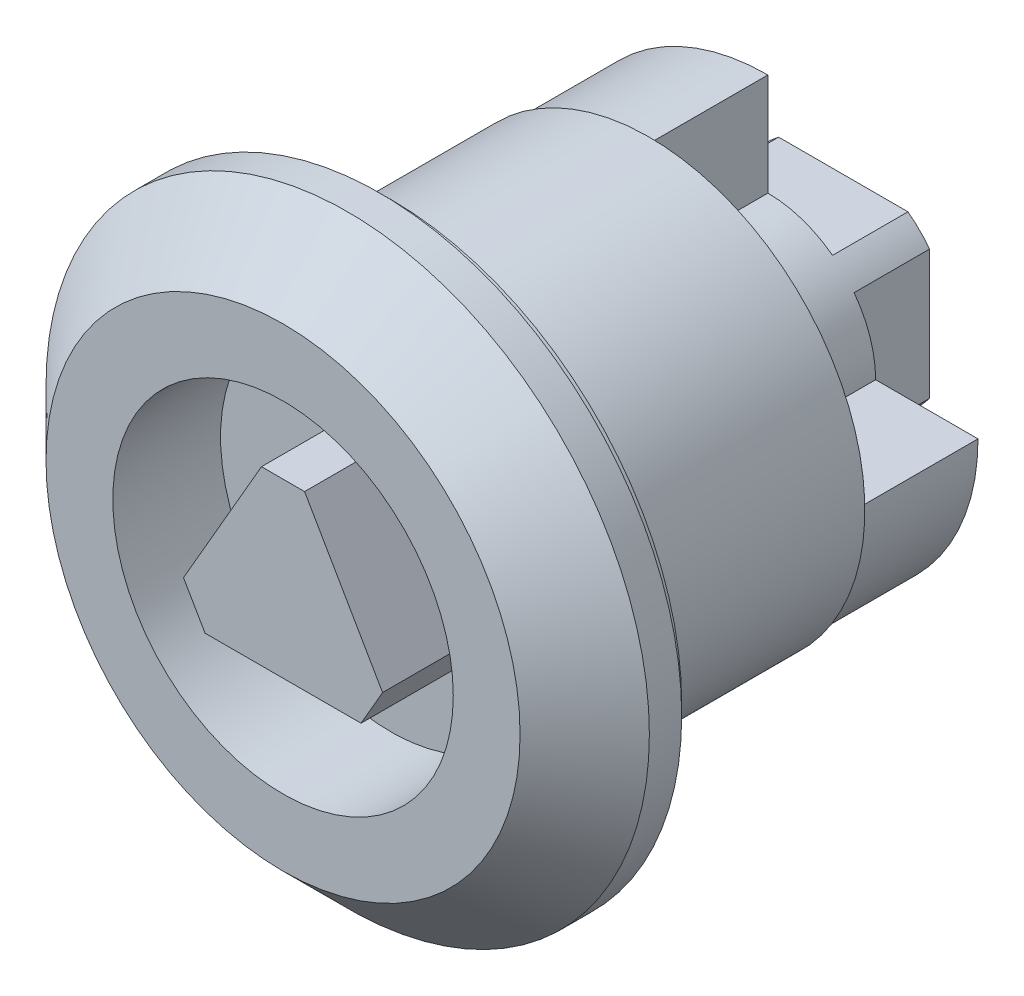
ISO-10303-21;
HEADER;
FILE_DESCRIPTION(('STEP AP214'),'2;1');
FILE_NAME('part.step','',(''),(''),'','','');
FILE_SCHEMA(('AUTOMOTIVE_DESIGN { 1 0 10303 214 1 1 1 1 }'));
ENDSEC;
DATA;
#1=APPLICATION_CONTEXT('core data for automotive mechanical design processes');
#2=APPLICATION_PROTOCOL_DEFINITION('international standard','automotive_design',2000,#1);
#3=PRODUCT_CONTEXT('',#1,'mechanical');
#4=PRODUCT('Part','Part','',(#3));
#5=PRODUCT_RELATED_PRODUCT_CATEGORY('part','',(#4));
#6=PRODUCT_DEFINITION_FORMATION('','',#4);
#7=PRODUCT_DEFINITION_CONTEXT('part definition',#1,'design');
#8=PRODUCT_DEFINITION('design','',#6,#7);
#9=PRODUCT_DEFINITION_SHAPE('','',#8);
#10=(LENGTH_UNIT() NAMED_UNIT(*) SI_UNIT(.MILLI.,.METRE.));
#11=(NAMED_UNIT(*) PLANE_ANGLE_UNIT() SI_UNIT($,.RADIAN.));
#12=(NAMED_UNIT(*) SI_UNIT($,.STERADIAN.) SOLID_ANGLE_UNIT());
#13=UNCERTAINTY_MEASURE_WITH_UNIT(LENGTH_MEASURE(1.E-05),#10,'distance_accuracy_value','');
#14=(GEOMETRIC_REPRESENTATION_CONTEXT(3) GLOBAL_UNCERTAINTY_ASSIGNED_CONTEXT((#13)) GLOBAL_UNIT_ASSIGNED_CONTEXT((#10,
#11,#12)) REPRESENTATION_CONTEXT('',''));
#15=CARTESIAN_POINT('',(0.,0.,0.));
#16=DIRECTION('',(0.,0.,1.));
#17=DIRECTION('',(1.,0.,0.));
#18=AXIS2_PLACEMENT_3D('',#15,#16,#17);
#19=CARTESIAN_POINT('',(0.,11.,5.));
#20=DIRECTION('',(0.,0.,1.));
#21=DIRECTION('',(1.,0.,0.));
#22=AXIS2_PLACEMENT_3D('',#19,#20,#21);
#23=PLANE('',#22);
#24=CARTESIAN_POINT('',(0.,0.,5.));
#25=DIRECTION('',(0.,0.,1.));
#26=DIRECTION('',(1.,0.,0.));
#27=AXIS2_PLACEMENT_3D('',#24,#25,#26);
#28=CIRCLE('',#27,7.9);
#29=CARTESIAN_POINT('',(7.9,0.,5.));
#30=VERTEX_POINT('',#29);
#31=EDGE_CURVE('E152',#30,#30,#28,.T.);
#32=ORIENTED_EDGE('',*,*,#31,.F.);
#33=EDGE_LOOP('',(#32));
#34=FACE_BOUND('',#33,.T.);
#35=CARTESIAN_POINT('',(0.,0.,5.));
#36=DIRECTION('',(0.,0.,-1.));
#37=DIRECTION('',(-1.,0.,0.));
#38=AXIS2_PLACEMENT_3D('',#35,#36,#37);
#39=CIRCLE('',#38,11.);
#40=CARTESIAN_POINT('',(-11.,0.,5.));
#41=VERTEX_POINT('',#40);
#42=EDGE_CURVE('E285',#41,#41,#39,.T.);
#43=ORIENTED_EDGE('',*,*,#42,.F.);
#44=EDGE_LOOP('',(#43));
#45=FACE_BOUND('',#44,.T.);
#46=ADVANCED_FACE('F14',(#34,#45),#23,.T.);
#47=CARTESIAN_POINT('',(0.,0.,-50.));
#48=DIRECTION('',(0.,0.,-1.));
#49=DIRECTION('',(-1.,0.,0.));
#50=AXIS2_PLACEMENT_3D('',#47,#48,#49);
#51=CYLINDRICAL_SURFACE('',#50,5.);
#52=CARTESIAN_POINT('',(0.,0.,-17.5));
#53=DIRECTION('',(0.,0.,-1.));
#54=DIRECTION('',(-1.,0.,0.));
#55=AXIS2_PLACEMENT_3D('',#52,#53,#54);
#56=CIRCLE('',#55,5.);
#57=CARTESIAN_POINT('',(-4.,3.,-17.5));
#58=VERTEX_POINT('',#57);
#59=CARTESIAN_POINT('',(-3.,4.,-17.5));
#60=VERTEX_POINT('',#59);
#61=EDGE_CURVE('E292',#58,#60,#56,.T.);
#62=ORIENTED_EDGE('',*,*,#61,.T.);
#63=DIRECTION('',(0.,0.,-1.));
#64=VECTOR('',#63,1.);
#65=CARTESIAN_POINT('',(-3.,4.,-11.4172374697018));
#66=LINE('',#65,#64);
#67=CARTESIAN_POINT('',(-3.,4.,-21.));
#68=VERTEX_POINT('',#67);
#69=EDGE_CURVE('E234',#60,#68,#66,.T.);
#70=ORIENTED_EDGE('',*,*,#69,.T.);
#71=CARTESIAN_POINT('',(0.,0.,-21.));
#72=DIRECTION('',(0.,0.,-1.));
#73=DIRECTION('',(-1.,0.,0.));
#74=AXIS2_PLACEMENT_3D('',#71,#72,#73);
#75=CIRCLE('',#74,5.);
#76=CARTESIAN_POINT('',(-4.,3.,-21.));
#77=VERTEX_POINT('',#76);
#78=EDGE_CURVE('E294',#77,#68,#75,.T.);
#79=ORIENTED_EDGE('',*,*,#78,.F.);
#80=DIRECTION('',(0.,0.,-1.));
#81=VECTOR('',#80,1.);
#82=CARTESIAN_POINT('',(-4.,3.,-11.4172374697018));
#83=LINE('',#82,#81);
#84=EDGE_CURVE('E258',#58,#77,#83,.T.);
#85=ORIENTED_EDGE('',*,*,#84,.F.);
#86=EDGE_LOOP('',(#62,#70,#79,#85));
#87=FACE_BOUND('',#86,.T.);
#88=ADVANCED_FACE('F350',(#87),#51,.T.);
#89=DIRECTION('',(0.,0.,-1.));
#90=VECTOR('',#89,1.);
#91=CARTESIAN_POINT('',(-3.,-4.,-11.4172374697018));
#92=LINE('',#91,#90);
#93=CARTESIAN_POINT('',(-3.,-4.,-17.5));
#94=VERTEX_POINT('',#93);
#95=CARTESIAN_POINT('',(-3.,-4.,-21.));
#96=VERTEX_POINT('',#95);
#97=EDGE_CURVE('E239',#94,#96,#92,.T.);
#98=ORIENTED_EDGE('',*,*,#97,.F.);
#99=CARTESIAN_POINT('',(-4.,-3.,-17.5));
#100=VERTEX_POINT('',#99);
#101=EDGE_CURVE('E299',#94,#100,#56,.T.);
#102=ORIENTED_EDGE('',*,*,#101,.T.);
#103=DIRECTION('',(0.,0.,-1.));
#104=VECTOR('',#103,1.);
#105=CARTESIAN_POINT('',(-4.,-3.,-11.4172374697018));
#106=LINE('',#105,#104);
#107=CARTESIAN_POINT('',(-4.,-3.,-21.));
#108=VERTEX_POINT('',#107);
#109=EDGE_CURVE('E255',#100,#108,#106,.T.);
#110=ORIENTED_EDGE('',*,*,#109,.T.);
#111=EDGE_CURVE('E293',#96,#108,#75,.T.);
#112=ORIENTED_EDGE('',*,*,#111,.F.);
#113=EDGE_LOOP('',(#98,#102,#110,#112));
#114=FACE_BOUND('',#113,.T.);
#115=ADVANCED_FACE('F346',(#114),#51,.T.);
#116=DIRECTION('',(0.,0.,-1.));
#117=VECTOR('',#116,1.);
#118=CARTESIAN_POINT('',(3.,-4.,-11.4172374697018));
#119=LINE('',#118,#117);
#120=CARTESIAN_POINT('',(3.,-4.,-17.5));
#121=VERTEX_POINT('',#120);
#122=CARTESIAN_POINT('',(3.,-4.,-21.));
#123=VERTEX_POINT('',#122);
#124=EDGE_CURVE('E244',#121,#123,#119,.T.);
#125=ORIENTED_EDGE('',*,*,#124,.T.);
#126=CARTESIAN_POINT('',(4.,-3.,-21.));
#127=VERTEX_POINT('',#126);
#128=EDGE_CURVE('E289',#127,#123,#75,.T.);
#129=ORIENTED_EDGE('',*,*,#128,.F.);
#130=DIRECTION('',(0.,0.,-1.));
#131=VECTOR('',#130,1.);
#132=CARTESIAN_POINT('',(4.,-3.,-11.4172374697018));
#133=LINE('',#132,#131);
#134=CARTESIAN_POINT('',(4.,-3.,-17.5));
#135=VERTEX_POINT('',#134);
#136=EDGE_CURVE('E260',#135,#127,#133,.T.);
#137=ORIENTED_EDGE('',*,*,#136,.F.);
#138=EDGE_CURVE('E295',#135,#121,#56,.T.);
#139=ORIENTED_EDGE('',*,*,#138,.T.);
#140=EDGE_LOOP('',(#125,#129,#137,#139));
#141=FACE_BOUND('',#140,.T.);
#142=ADVANCED_FACE('F359',(#141),#51,.T.);
#143=CARTESIAN_POINT('',(0.,5.,-21.));
#144=DIRECTION('',(0.,0.,1.));
#145=DIRECTION('',(1.,0.,0.));
#146=AXIS2_PLACEMENT_3D('',#143,#144,#145);
#147=PLANE('',#146);
#148=CARTESIAN_POINT('',(0.,0.,-21.));
#149=DIRECTION('',(0.,0.,-1.));
#150=DIRECTION('',(-1.,0.,0.));
#151=AXIS2_PLACEMENT_3D('',#148,#149,#150);
#152=CIRCLE('',#151,3.);
#153=CARTESIAN_POINT('',(-3.,0.,-21.));
#154=VERTEX_POINT('',#153);
#155=EDGE_CURVE('E202',#154,#154,#152,.T.);
#156=ORIENTED_EDGE('',*,*,#155,.F.);
#157=EDGE_LOOP('',(#156));
#158=FACE_BOUND('',#157,.T.);
#159=ORIENTED_EDGE('',*,*,#78,.T.);
#160=DIRECTION('',(-1.,0.,0.));
#161=VECTOR('',#160,1.);
#162=CARTESIAN_POINT('',(3.,4.,-21.));
#163=LINE('',#162,#161);
#164=CARTESIAN_POINT('',(3.,4.,-21.));
#165=VERTEX_POINT('',#164);
#166=EDGE_CURVE('E224',#165,#68,#163,.T.);
#167=ORIENTED_EDGE('',*,*,#166,.F.);
#168=CARTESIAN_POINT('',(4.,3.,-21.));
#169=VERTEX_POINT('',#168);
#170=EDGE_CURVE('E288',#165,#169,#75,.T.);
#171=ORIENTED_EDGE('',*,*,#170,.T.);
#172=DIRECTION('',(0.,-1.,0.));
#173=VECTOR('',#172,1.);
#174=CARTESIAN_POINT('',(4.,3.,-21.));
#175=LINE('',#174,#173);
#176=EDGE_CURVE('E261',#169,#127,#175,.T.);
#177=ORIENTED_EDGE('',*,*,#176,.T.);
#178=ORIENTED_EDGE('',*,*,#128,.T.);
#179=DIRECTION('',(-1.,0.,0.));
#180=VECTOR('',#179,1.);
#181=CARTESIAN_POINT('',(3.,-4.,-21.));
#182=LINE('',#181,#180);
#183=EDGE_CURVE('E240',#123,#96,#182,.T.);
#184=ORIENTED_EDGE('',*,*,#183,.T.);
#185=ORIENTED_EDGE('',*,*,#111,.T.);
#186=DIRECTION('',(0.,-1.,0.));
#187=VECTOR('',#186,1.);
#188=CARTESIAN_POINT('',(-4.,3.,-21.));
#189=LINE('',#188,#187);
#190=EDGE_CURVE('E246',#77,#108,#189,.T.);
#191=ORIENTED_EDGE('',*,*,#190,.F.);
#192=EDGE_LOOP('',(#159,#167,#171,#177,#178,#184,#185,#191));
#193=FACE_BOUND('',#192,.T.);
#194=ADVANCED_FACE('F334',(#158,#193),#147,.F.);
#195=ORIENTED_EDGE('',*,*,#170,.F.);
#196=DIRECTION('',(0.,0.,-1.));
#197=VECTOR('',#196,1.);
#198=CARTESIAN_POINT('',(3.,4.,-11.4172374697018));
#199=LINE('',#198,#197);
#200=CARTESIAN_POINT('',(3.,4.,-17.5));
#201=VERTEX_POINT('',#200);
#202=EDGE_CURVE('E237',#201,#165,#199,.T.);
#203=ORIENTED_EDGE('',*,*,#202,.F.);
#204=CARTESIAN_POINT('',(0.,0.,-17.5));
#205=DIRECTION('',(0.,0.,-1.));
#206=DIRECTION('',(-1.,0.,0.));
#207=AXIS2_PLACEMENT_3D('',#204,#205,#206);
#208=CIRCLE('',#207,5.);
#209=CARTESIAN_POINT('',(0.,5.,-17.5));
#210=VERTEX_POINT('',#209);
#211=EDGE_CURVE('E212',#210,#201,#208,.T.);
#212=ORIENTED_EDGE('',*,*,#211,.F.);
#213=DIRECTION('',(0.,0.,-1.));
#214=VECTOR('',#213,1.);
#215=CARTESIAN_POINT('',(0.,5.,1.78858223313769));
#216=LINE('',#215,#214);
#217=CARTESIAN_POINT('',(0.,5.,-12.));
#218=VERTEX_POINT('',#217);
#219=EDGE_CURVE('E227',#218,#210,#216,.T.);
#220=ORIENTED_EDGE('',*,*,#219,.F.);
#221=CARTESIAN_POINT('',(0.,0.,-12.));
#222=DIRECTION('',(0.,0.,1.));
#223=DIRECTION('',(1.,0.,0.));
#224=AXIS2_PLACEMENT_3D('',#221,#222,#223);
#225=CIRCLE('',#224,5.);
#226=CARTESIAN_POINT('',(5.,0.,-12.));
#227=VERTEX_POINT('',#226);
#228=EDGE_CURVE('E210',#218,#227,#225,.F.);
#229=ORIENTED_EDGE('',*,*,#228,.T.);
#230=DIRECTION('',(0.,0.,-1.));
#231=VECTOR('',#230,1.);
#232=CARTESIAN_POINT('',(5.,0.,1.78858223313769));
#233=LINE('',#232,#231);
#234=CARTESIAN_POINT('',(5.,0.,-17.5));
#235=VERTEX_POINT('',#234);
#236=EDGE_CURVE('E214',#227,#235,#233,.T.);
#237=ORIENTED_EDGE('',*,*,#236,.T.);
#238=CARTESIAN_POINT('',(4.,3.,-17.5));
#239=VERTEX_POINT('',#238);
#240=EDGE_CURVE('E215',#239,#235,#208,.T.);
#241=ORIENTED_EDGE('',*,*,#240,.F.);
#242=DIRECTION('',(0.,0.,-1.));
#243=VECTOR('',#242,1.);
#244=CARTESIAN_POINT('',(4.,3.,-11.4172374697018));
#245=LINE('',#244,#243);
#246=EDGE_CURVE('E265',#239,#169,#245,.T.);
#247=ORIENTED_EDGE('',*,*,#246,.T.);
#248=EDGE_LOOP('',(#195,#203,#212,#220,#229,#237,#241,#247));
#249=FACE_BOUND('',#248,.T.);
#250=ADVANCED_FACE('F325',(#249),#51,.T.);
#251=CARTESIAN_POINT('',(0.,0.,-50.));
#252=DIRECTION('',(0.,0.,-1.));
#253=DIRECTION('',(-1.,0.,0.));
#254=AXIS2_PLACEMENT_3D('',#251,#252,#253);
#255=CYLINDRICAL_SURFACE('',#254,10.);
#256=CARTESIAN_POINT('',(0.,0.,-12.));
#257=DIRECTION('',(0.,0.,-1.));
#258=DIRECTION('',(-1.,0.,0.));
#259=AXIS2_PLACEMENT_3D('',#256,#257,#258);
#260=CIRCLE('',#259,10.);
#261=CARTESIAN_POINT('',(-10.,0.,-12.));
#262=VERTEX_POINT('',#261);
#263=EDGE_CURVE('E9',#262,#262,#260,.T.);
#264=ORIENTED_EDGE('',*,*,#263,.F.);
#265=EDGE_LOOP('',(#264));
#266=FACE_BOUND('',#265,.T.);
#267=CARTESIAN_POINT('',(0.,0.,0.));
#268=DIRECTION('',(0.,0.,-1.));
#269=DIRECTION('',(-1.,0.,0.));
#270=AXIS2_PLACEMENT_3D('',#267,#268,#269);
#271=CIRCLE('',#270,10.);
#272=CARTESIAN_POINT('',(-10.,0.,0.));
#273=VERTEX_POINT('',#272);
#274=EDGE_CURVE('E267',#273,#273,#271,.T.);
#275=ORIENTED_EDGE('',*,*,#274,.T.);
#276=EDGE_LOOP('',(#275));
#277=FACE_BOUND('',#276,.T.);
#278=ADVANCED_FACE('F16',(#266,#277),#255,.T.);
#279=CARTESIAN_POINT('',(0.,10.,-12.));
#280=DIRECTION('',(0.,0.,1.));
#281=DIRECTION('',(1.,0.,0.));
#282=AXIS2_PLACEMENT_3D('',#279,#280,#281);
#283=PLANE('',#282);
#284=CARTESIAN_POINT('',(0.,0.,-12.));
#285=DIRECTION('',(0.,0.,-1.));
#286=DIRECTION('',(-1.,0.,0.));
#287=AXIS2_PLACEMENT_3D('',#284,#285,#286);
#288=CIRCLE('',#287,9.75);
#289=CARTESIAN_POINT('',(9.75,0.,-12.));
#290=VERTEX_POINT('',#289);
#291=CARTESIAN_POINT('',(0.,9.75,-12.));
#292=VERTEX_POINT('',#291);
#293=EDGE_CURVE('E22',#290,#292,#288,.T.);
#294=ORIENTED_EDGE('',*,*,#293,.F.);
#295=DIRECTION('',(1.,0.,0.));
#296=VECTOR('',#295,1.);
#297=CARTESIAN_POINT('',(5.,0.,-12.));
#298=LINE('',#297,#296);
#299=EDGE_CURVE('E219',#227,#290,#298,.T.);
#300=ORIENTED_EDGE('',*,*,#299,.F.);
#301=ORIENTED_EDGE('',*,*,#228,.F.);
#302=DIRECTION('',(0.,1.,0.));
#303=VECTOR('',#302,1.);
#304=CARTESIAN_POINT('',(0.,5.,-12.));
#305=LINE('',#304,#303);
#306=EDGE_CURVE('E220',#218,#292,#305,.T.);
#307=ORIENTED_EDGE('',*,*,#306,.T.);
#308=EDGE_LOOP('',(#294,#300,#301,#307));
#309=FACE_BOUND('',#308,.T.);
#310=ORIENTED_EDGE('',*,*,#263,.T.);
#311=EDGE_LOOP('',(#310));
#312=FACE_BOUND('',#311,.T.);
#313=ADVANCED_FACE('F309',(#309,#312),#283,.F.);
#314=CARTESIAN_POINT('',(0.,0.,-50.));
#315=DIRECTION('',(0.,0.,-1.));
#316=DIRECTION('',(-1.,0.,0.));
#317=AXIS2_PLACEMENT_3D('',#314,#315,#316);
#318=CYLINDRICAL_SURFACE('',#317,9.75);
#319=ORIENTED_EDGE('',*,*,#293,.T.);
#320=DIRECTION('',(0.,0.,-1.));
#321=VECTOR('',#320,1.);
#322=CARTESIAN_POINT('',(0.,9.75,1.78858223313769));
#323=LINE('',#322,#321);
#324=CARTESIAN_POINT('',(0.,9.75,-17.5));
#325=VERTEX_POINT('',#324);
#326=EDGE_CURVE('E222',#292,#325,#323,.T.);
#327=ORIENTED_EDGE('',*,*,#326,.T.);
#328=CARTESIAN_POINT('',(0.,0.,-17.5));
#329=DIRECTION('',(0.,0.,-1.));
#330=DIRECTION('',(-1.,0.,0.));
#331=AXIS2_PLACEMENT_3D('',#328,#329,#330);
#332=CIRCLE('',#331,9.75);
#333=CARTESIAN_POINT('',(9.75,0.,-17.5));
#334=VERTEX_POINT('',#333);
#335=EDGE_CURVE('E298',#334,#325,#332,.T.);
#336=ORIENTED_EDGE('',*,*,#335,.F.);
#337=DIRECTION('',(0.,0.,-1.));
#338=VECTOR('',#337,1.);
#339=CARTESIAN_POINT('',(9.75,0.,1.78858223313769));
#340=LINE('',#339,#338);
#341=EDGE_CURVE('E37',#290,#334,#340,.T.);
#342=ORIENTED_EDGE('',*,*,#341,.F.);
#343=EDGE_LOOP('',(#319,#327,#336,#342));
#344=FACE_BOUND('',#343,.T.);
#345=ADVANCED_FACE('F304',(#344),#318,.T.);
#346=CARTESIAN_POINT('',(0.,9.75,-17.5));
#347=DIRECTION('',(0.,0.,1.));
#348=DIRECTION('',(1.,0.,0.));
#349=AXIS2_PLACEMENT_3D('',#346,#347,#348);
#350=PLANE('',#349);
#351=ORIENTED_EDGE('',*,*,#335,.T.);
#352=DIRECTION('',(0.,1.,0.));
#353=VECTOR('',#352,1.);
#354=CARTESIAN_POINT('',(0.,5.,-17.5));
#355=LINE('',#354,#353);
#356=EDGE_CURVE('E208',#210,#325,#355,.T.);
#357=ORIENTED_EDGE('',*,*,#356,.F.);
#358=ORIENTED_EDGE('',*,*,#211,.T.);
#359=DIRECTION('',(-1.,0.,0.));
#360=VECTOR('',#359,1.);
#361=CARTESIAN_POINT('',(3.,4.,-17.5));
#362=LINE('',#361,#360);
#363=EDGE_CURVE('E232',#201,#60,#362,.T.);
#364=ORIENTED_EDGE('',*,*,#363,.T.);
#365=ORIENTED_EDGE('',*,*,#61,.F.);
#366=DIRECTION('',(0.,-1.,0.));
#367=VECTOR('',#366,1.);
#368=CARTESIAN_POINT('',(-4.,3.,-17.5));
#369=LINE('',#368,#367);
#370=EDGE_CURVE('E252',#58,#100,#369,.T.);
#371=ORIENTED_EDGE('',*,*,#370,.T.);
#372=ORIENTED_EDGE('',*,*,#101,.F.);
#373=DIRECTION('',(-1.,0.,0.));
#374=VECTOR('',#373,1.);
#375=CARTESIAN_POINT('',(3.,-4.,-17.5));
#376=LINE('',#375,#374);
#377=EDGE_CURVE('E243',#121,#94,#376,.T.);
#378=ORIENTED_EDGE('',*,*,#377,.F.);
#379=ORIENTED_EDGE('',*,*,#138,.F.);
#380=DIRECTION('',(0.,-1.,0.));
#381=VECTOR('',#380,1.);
#382=CARTESIAN_POINT('',(4.,3.,-17.5));
#383=LINE('',#382,#381);
#384=EDGE_CURVE('E264',#239,#135,#383,.T.);
#385=ORIENTED_EDGE('',*,*,#384,.F.);
#386=ORIENTED_EDGE('',*,*,#240,.T.);
#387=DIRECTION('',(1.,0.,0.));
#388=VECTOR('',#387,1.);
#389=CARTESIAN_POINT('',(5.,0.,-17.5));
#390=LINE('',#389,#388);
#391=EDGE_CURVE('E211',#235,#334,#390,.T.);
#392=ORIENTED_EDGE('',*,*,#391,.T.);
#393=EDGE_LOOP('',(#351,#357,#358,#364,#365,#371,#372,#378,#379,#385,#386,#392));
#394=FACE_BOUND('',#393,.T.);
#395=ADVANCED_FACE('F318',(#394),#350,.F.);
#396=CARTESIAN_POINT('',(0.,0.,5.));
#397=DIRECTION('',(0.,0.,-1.));
#398=DIRECTION('',(-1.,0.,0.));
#399=AXIS2_PLACEMENT_3D('',#396,#397,#398);
#400=CONICAL_SURFACE('',#399,11.,0.785398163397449);
#401=CARTESIAN_POINT('',(0.,0.,2.));
#402=DIRECTION('',(0.,0.,-1.));
#403=DIRECTION('',(-1.,0.,0.));
#404=AXIS2_PLACEMENT_3D('',#401,#402,#403);
#405=CIRCLE('',#404,14.);
#406=CARTESIAN_POINT('',(-14.,0.,2.));
#407=VERTEX_POINT('',#406);
#408=EDGE_CURVE('E282',#407,#407,#405,.T.);
#409=ORIENTED_EDGE('',*,*,#408,.F.);
#410=EDGE_LOOP('',(#409));
#411=FACE_BOUND('',#410,.T.);
#412=ORIENTED_EDGE('',*,*,#42,.T.);
#413=EDGE_LOOP('',(#412));
#414=FACE_BOUND('',#413,.T.);
#415=ADVANCED_FACE('F413',(#411,#414),#400,.T.);
#416=CARTESIAN_POINT('',(0.,0.,-50.));
#417=DIRECTION('',(0.,0.,-1.));
#418=DIRECTION('',(-1.,0.,0.));
#419=AXIS2_PLACEMENT_3D('',#416,#417,#418);
#420=CYLINDRICAL_SURFACE('',#419,14.);
#421=CARTESIAN_POINT('',(0.,0.,0.500000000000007));
#422=DIRECTION('',(0.,0.,-1.));
#423=DIRECTION('',(-1.,0.,0.));
#424=AXIS2_PLACEMENT_3D('',#421,#422,#423);
#425=CIRCLE('',#424,14.);
#426=CARTESIAN_POINT('',(-14.,0.,0.500000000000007));
#427=VERTEX_POINT('',#426);
#428=EDGE_CURVE('E279',#427,#427,#425,.T.);
#429=ORIENTED_EDGE('',*,*,#428,.F.);
#430=EDGE_LOOP('',(#429));
#431=FACE_BOUND('',#430,.T.);
#432=ORIENTED_EDGE('',*,*,#408,.T.);
#433=EDGE_LOOP('',(#432));
#434=FACE_BOUND('',#433,.T.);
#435=ADVANCED_FACE('F409',(#431,#434),#420,.T.);
#436=CARTESIAN_POINT('',(0.,14.,0.50000000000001));
#437=DIRECTION('',(0.,0.,1.));
#438=DIRECTION('',(1.,0.,0.));
#439=AXIS2_PLACEMENT_3D('',#436,#437,#438);
#440=PLANE('',#439);
#441=CARTESIAN_POINT('',(0.,0.,0.500000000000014));
#442=DIRECTION('',(0.,0.,-1.));
#443=DIRECTION('',(-1.,0.,0.));
#444=AXIS2_PLACEMENT_3D('',#441,#442,#443);
#445=CIRCLE('',#444,13.5);
#446=CARTESIAN_POINT('',(-13.5,0.,0.500000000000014));
#447=VERTEX_POINT('',#446);
#448=EDGE_CURVE('E276',#447,#447,#445,.T.);
#449=ORIENTED_EDGE('',*,*,#448,.F.);
#450=EDGE_LOOP('',(#449));
#451=FACE_BOUND('',#450,.T.);
#452=ORIENTED_EDGE('',*,*,#428,.T.);
#453=EDGE_LOOP('',(#452));
#454=FACE_BOUND('',#453,.T.);
#455=ADVANCED_FACE('F405',(#451,#454),#440,.F.);
#456=CARTESIAN_POINT('',(0.,0.,-50.));
#457=DIRECTION('',(0.,0.,-1.));
#458=DIRECTION('',(-1.,0.,0.));
#459=AXIS2_PLACEMENT_3D('',#456,#457,#458);
#460=CYLINDRICAL_SURFACE('',#459,13.5);
#461=ORIENTED_EDGE('',*,*,#448,.T.);
#462=EDGE_LOOP('',(#461));
#463=FACE_BOUND('',#462,.T.);
#464=CARTESIAN_POINT('',(0.,0.,0.));
#465=DIRECTION('',(0.,0.,-1.));
#466=DIRECTION('',(-1.,0.,0.));
#467=AXIS2_PLACEMENT_3D('',#464,#465,#466);
#468=CIRCLE('',#467,13.5);
#469=CARTESIAN_POINT('',(-13.5,0.,0.));
#470=VERTEX_POINT('',#469);
#471=EDGE_CURVE('E273',#470,#470,#468,.T.);
#472=ORIENTED_EDGE('',*,*,#471,.F.);
#473=EDGE_LOOP('',(#472));
#474=FACE_BOUND('',#473,.T.);
#475=ADVANCED_FACE('F401',(#463,#474),#460,.T.);
#476=CARTESIAN_POINT('',(0.,13.5,0.));
#477=DIRECTION('',(0.,0.,1.));
#478=DIRECTION('',(1.,0.,0.));
#479=AXIS2_PLACEMENT_3D('',#476,#477,#478);
#480=PLANE('',#479);
#481=ORIENTED_EDGE('',*,*,#274,.F.);
#482=EDGE_LOOP('',(#481));
#483=FACE_BOUND('',#482,.T.);
#484=ORIENTED_EDGE('',*,*,#471,.T.);
#485=EDGE_LOOP('',(#484));
#486=FACE_BOUND('',#485,.T.);
#487=ADVANCED_FACE('F398',(#483,#486),#480,.F.);
#488=CARTESIAN_POINT('',(4.,3.,-11.4172374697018));
#489=DIRECTION('',(1.,0.,0.));
#490=DIRECTION('',(0.,0.,-1.));
#491=AXIS2_PLACEMENT_3D('',#488,#489,#490);
#492=PLANE('',#491);
#493=ORIENTED_EDGE('',*,*,#384,.T.);
#494=ORIENTED_EDGE('',*,*,#136,.T.);
#495=ORIENTED_EDGE('',*,*,#176,.F.);
#496=ORIENTED_EDGE('',*,*,#246,.F.);
#497=EDGE_LOOP('',(#493,#494,#495,#496));
#498=FACE_BOUND('',#497,.T.);
#499=ADVANCED_FACE('F383',(#498),#492,.T.);
#500=CARTESIAN_POINT('',(-4.,3.,-11.4172374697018));
#501=DIRECTION('',(1.,0.,0.));
#502=DIRECTION('',(0.,0.,-1.));
#503=AXIS2_PLACEMENT_3D('',#500,#501,#502);
#504=PLANE('',#503);
#505=ORIENTED_EDGE('',*,*,#84,.T.);
#506=ORIENTED_EDGE('',*,*,#190,.T.);
#507=ORIENTED_EDGE('',*,*,#109,.F.);
#508=ORIENTED_EDGE('',*,*,#370,.F.);
#509=EDGE_LOOP('',(#505,#506,#507,#508));
#510=FACE_BOUND('',#509,.T.);
#511=ADVANCED_FACE('F345',(#510),#504,.F.);
#512=CARTESIAN_POINT('',(3.,-4.,-11.4172374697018));
#513=DIRECTION('',(0.,-1.,0.));
#514=DIRECTION('',(1.,0.,0.));
#515=AXIS2_PLACEMENT_3D('',#512,#513,#514);
#516=PLANE('',#515);
#517=ORIENTED_EDGE('',*,*,#377,.T.);
#518=ORIENTED_EDGE('',*,*,#97,.T.);
#519=ORIENTED_EDGE('',*,*,#183,.F.);
#520=ORIENTED_EDGE('',*,*,#124,.F.);
#521=EDGE_LOOP('',(#517,#518,#519,#520));
#522=FACE_BOUND('',#521,.T.);
#523=ADVANCED_FACE('F384',(#522),#516,.T.);
#524=CARTESIAN_POINT('',(3.,4.,-11.4172374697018));
#525=DIRECTION('',(0.,-1.,0.));
#526=DIRECTION('',(1.,0.,0.));
#527=AXIS2_PLACEMENT_3D('',#524,#525,#526);
#528=PLANE('',#527);
#529=ORIENTED_EDGE('',*,*,#202,.T.);
#530=ORIENTED_EDGE('',*,*,#166,.T.);
#531=ORIENTED_EDGE('',*,*,#69,.F.);
#532=ORIENTED_EDGE('',*,*,#363,.F.);
#533=EDGE_LOOP('',(#529,#530,#531,#532));
#534=FACE_BOUND('',#533,.T.);
#535=ADVANCED_FACE('F330',(#534),#528,.F.);
#536=CARTESIAN_POINT('',(0.,5.,1.78858223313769));
#537=DIRECTION('',(-1.,0.,0.));
#538=DIRECTION('',(0.,0.,1.));
#539=AXIS2_PLACEMENT_3D('',#536,#537,#538);
#540=PLANE('',#539);
#541=ORIENTED_EDGE('',*,*,#219,.T.);
#542=ORIENTED_EDGE('',*,*,#356,.T.);
#543=ORIENTED_EDGE('',*,*,#326,.F.);
#544=ORIENTED_EDGE('',*,*,#306,.F.);
#545=EDGE_LOOP('',(#541,#542,#543,#544));
#546=FACE_BOUND('',#545,.T.);
#547=ADVANCED_FACE('F314',(#546),#540,.F.);
#548=CARTESIAN_POINT('',(5.,0.,1.78858223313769));
#549=DIRECTION('',(0.,1.,0.));
#550=DIRECTION('',(-1.,0.,0.));
#551=AXIS2_PLACEMENT_3D('',#548,#549,#550);
#552=PLANE('',#551);
#553=ORIENTED_EDGE('',*,*,#299,.T.);
#554=ORIENTED_EDGE('',*,*,#341,.T.);
#555=ORIENTED_EDGE('',*,*,#391,.F.);
#556=ORIENTED_EDGE('',*,*,#236,.F.);
#557=EDGE_LOOP('',(#553,#554,#555,#556));
#558=FACE_BOUND('',#557,.T.);
#559=ADVANCED_FACE('F322',(#558),#552,.T.);
#560=CARTESIAN_POINT('',(0.,0.,-11.));
#561=DIRECTION('',(0.,0.,-1.));
#562=DIRECTION('',(-1.,0.,0.));
#563=AXIS2_PLACEMENT_3D('',#560,#561,#562);
#564=CYLINDRICAL_SURFACE('',#563,3.);
#565=CARTESIAN_POINT('',(0.,0.,-11.));
#566=DIRECTION('',(0.,0.,-1.));
#567=DIRECTION('',(-1.,0.,0.));
#568=AXIS2_PLACEMENT_3D('',#565,#566,#567);
#569=CIRCLE('',#568,3.);
#570=CARTESIAN_POINT('',(-3.,0.,-11.));
#571=VERTEX_POINT('',#570);
#572=EDGE_CURVE('E205',#571,#571,#569,.T.);
#573=ORIENTED_EDGE('',*,*,#572,.F.);
#574=EDGE_LOOP('',(#573));
#575=FACE_BOUND('',#574,.T.);
#576=ORIENTED_EDGE('',*,*,#155,.T.);
#577=EDGE_LOOP('',(#576));
#578=FACE_BOUND('',#577,.T.);
#579=ADVANCED_FACE('F450',(#575,#578),#564,.F.);
#580=CARTESIAN_POINT('',(0.,0.,-11.));
#581=DIRECTION('',(0.,0.,-1.));
#582=DIRECTION('',(-1.,0.,0.));
#583=AXIS2_PLACEMENT_3D('',#580,#581,#582);
#584=PLANE('',#583);
#585=ORIENTED_EDGE('',*,*,#572,.T.);
#586=EDGE_LOOP('',(#585));
#587=FACE_BOUND('',#586,.T.);
#588=ADVANCED_FACE('F448',(#587),#584,.T.);
#589=CARTESIAN_POINT('',(0.,0.,0.));
#590=DIRECTION('',(0.,0.,1.));
#591=DIRECTION('',(1.,0.,0.));
#592=AXIS2_PLACEMENT_3D('',#589,#590,#591);
#593=PLANE('',#592);
#594=CARTESIAN_POINT('',(0.,0.,0.));
#595=DIRECTION('',(0.,0.,1.));
#596=DIRECTION('',(1.,0.,0.));
#597=AXIS2_PLACEMENT_3D('',#594,#595,#596);
#598=CIRCLE('',#597,7.9);
#599=CARTESIAN_POINT('',(7.9,0.,0.));
#600=VERTEX_POINT('',#599);
#601=EDGE_CURVE('E199',#600,#600,#598,.T.);
#602=ORIENTED_EDGE('',*,*,#601,.T.);
#603=EDGE_LOOP('',(#602));
#604=FACE_BOUND('',#603,.T.);
#605=DIRECTION('',(-0.5,-0.866025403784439,0.));
#606=VECTOR('',#605,1.);
#607=CARTESIAN_POINT('',(4.61880215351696,-1.51199999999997,0.));
#608=LINE('',#607,#606);
#609=CARTESIAN_POINT('',(4.61880215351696,-1.51199999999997,0.));
#610=VERTEX_POINT('',#609);
#611=CARTESIAN_POINT('',(3.61883148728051,-3.244,0.));
#612=VERTEX_POINT('',#611);
#613=EDGE_CURVE('E175',#610,#612,#608,.T.);
#614=ORIENTED_EDGE('',*,*,#613,.T.);
#615=DIRECTION('',(1.,0.,0.));
#616=VECTOR('',#615,1.);
#617=CARTESIAN_POINT('',(-3.61883148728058,-3.24399999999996,0.));
#618=LINE('',#617,#616);
#619=CARTESIAN_POINT('',(-3.61883148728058,-3.24399999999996,0.));
#620=VERTEX_POINT('',#619);
#621=EDGE_CURVE('E148',#620,#612,#618,.T.);
#622=ORIENTED_EDGE('',*,*,#621,.F.);
#623=DIRECTION('',(0.5,-0.866025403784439,0.));
#624=VECTOR('',#623,1.);
#625=CARTESIAN_POINT('',(-4.61880215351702,-1.51199999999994,0.));
#626=LINE('',#625,#624);
#627=CARTESIAN_POINT('',(-4.61880215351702,-1.51199999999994,0.));
#628=VERTEX_POINT('',#627);
#629=EDGE_CURVE('E178',#628,#620,#626,.T.);
#630=ORIENTED_EDGE('',*,*,#629,.F.);
#631=DIRECTION('',(-0.5,-0.866025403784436,0.));
#632=VECTOR('',#631,1.);
#633=CARTESIAN_POINT('',(-0.999970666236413,4.756,0.));
#634=LINE('',#633,#632);
#635=CARTESIAN_POINT('',(-0.999970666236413,4.756,0.));
#636=VERTEX_POINT('',#635);
#637=EDGE_CURVE('E181',#636,#628,#634,.T.);
#638=ORIENTED_EDGE('',*,*,#637,.F.);
#639=DIRECTION('',(1.,0.,0.));
#640=VECTOR('',#639,1.);
#641=CARTESIAN_POINT('',(-0.999970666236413,4.756,0.));
#642=LINE('',#641,#640);
#643=CARTESIAN_POINT('',(0.999970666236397,4.756,0.));
#644=VERTEX_POINT('',#643);
#645=EDGE_CURVE('E184',#636,#644,#642,.T.);
#646=ORIENTED_EDGE('',*,*,#645,.T.);
#647=DIRECTION('',(0.5,-0.86602540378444,0.));
#648=VECTOR('',#647,1.);
#649=CARTESIAN_POINT('',(0.999970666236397,4.756,0.));
#650=LINE('',#649,#648);
#651=EDGE_CURVE('E186',#644,#610,#650,.T.);
#652=ORIENTED_EDGE('',*,*,#651,.T.);
#653=EDGE_LOOP('',(#614,#622,#630,#638,#646,#652));
#654=FACE_BOUND('',#653,.T.);
#655=ADVANCED_FACE('F444',(#604,#654),#593,.T.);
#656=CARTESIAN_POINT('',(0.,0.,0.));
#657=DIRECTION('',(0.,0.,1.));
#658=DIRECTION('',(1.,0.,0.));
#659=AXIS2_PLACEMENT_3D('',#656,#657,#658);
#660=CYLINDRICAL_SURFACE('',#659,7.9);
#661=ORIENTED_EDGE('',*,*,#601,.F.);
#662=EDGE_LOOP('',(#661));
#663=FACE_BOUND('',#662,.T.);
#664=ORIENTED_EDGE('',*,*,#31,.T.);
#665=EDGE_LOOP('',(#664));
#666=FACE_BOUND('',#665,.T.);
#667=ADVANCED_FACE('F447',(#663,#666),#660,.F.);
#668=CARTESIAN_POINT('',(4.61880215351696,-1.51199999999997,0.));
#669=DIRECTION('',(-0.866025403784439,0.5,0.));
#670=DIRECTION('',(-0.5,-0.866025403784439,0.));
#671=AXIS2_PLACEMENT_3D('',#668,#669,#670);
#672=PLANE('',#671);
#673=DIRECTION('',(0.,0.,1.));
#674=VECTOR('',#673,1.);
#675=CARTESIAN_POINT('',(3.61883148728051,-3.244,0.));
#676=LINE('',#675,#674);
#677=CARTESIAN_POINT('',(3.61883148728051,-3.244,5.));
#678=VERTEX_POINT('',#677);
#679=EDGE_CURVE('E141',#612,#678,#676,.T.);
#680=ORIENTED_EDGE('',*,*,#679,.F.);
#681=ORIENTED_EDGE('',*,*,#613,.F.);
#682=DIRECTION('',(0.,0.,1.));
#683=VECTOR('',#682,1.);
#684=CARTESIAN_POINT('',(4.61880215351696,-1.51199999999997,0.));
#685=LINE('',#684,#683);
#686=CARTESIAN_POINT('',(4.61880215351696,-1.51199999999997,5.));
#687=VERTEX_POINT('',#686);
#688=EDGE_CURVE('E158',#610,#687,#685,.T.);
#689=ORIENTED_EDGE('',*,*,#688,.T.);
#690=DIRECTION('',(-0.5,-0.866025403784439,0.));
#691=VECTOR('',#690,1.);
#692=CARTESIAN_POINT('',(4.61880215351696,-1.51199999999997,5.));
#693=LINE('',#692,#691);
#694=EDGE_CURVE('E156',#687,#678,#693,.T.);
#695=ORIENTED_EDGE('',*,*,#694,.T.);
#696=EDGE_LOOP('',(#680,#681,#689,#695));
#697=FACE_BOUND('',#696,.T.);
#698=ADVANCED_FACE('F157',(#697),#672,.F.);
#699=CARTESIAN_POINT('',(-3.61883148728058,-3.24399999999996,0.));
#700=DIRECTION('',(0.,-1.,0.));
#701=DIRECTION('',(1.,0.,0.));
#702=AXIS2_PLACEMENT_3D('',#699,#700,#701);
#703=PLANE('',#702);
#704=DIRECTION('',(0.,0.,1.));
#705=VECTOR('',#704,1.);
#706=CARTESIAN_POINT('',(-3.61883148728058,-3.24399999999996,0.));
#707=LINE('',#706,#705);
#708=CARTESIAN_POINT('',(-3.61883148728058,-3.24399999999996,5.));
#709=VERTEX_POINT('',#708);
#710=EDGE_CURVE('E153',#620,#709,#707,.T.);
#711=ORIENTED_EDGE('',*,*,#710,.F.);
#712=ORIENTED_EDGE('',*,*,#621,.T.);
#713=ORIENTED_EDGE('',*,*,#679,.T.);
#714=DIRECTION('',(1.,0.,0.));
#715=VECTOR('',#714,1.);
#716=CARTESIAN_POINT('',(-3.61883148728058,-3.24399999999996,5.));
#717=LINE('',#716,#715);
#718=EDGE_CURVE('E145',#709,#678,#717,.T.);
#719=ORIENTED_EDGE('',*,*,#718,.F.);
#720=EDGE_LOOP('',(#711,#712,#713,#719));
#721=FACE_BOUND('',#720,.T.);
#722=ADVANCED_FACE('F143',(#721),#703,.T.);
#723=CARTESIAN_POINT('',(-4.61880215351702,-1.51199999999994,0.));
#724=DIRECTION('',(-0.866025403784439,-0.5,0.));
#725=DIRECTION('',(0.5,-0.866025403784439,0.));
#726=AXIS2_PLACEMENT_3D('',#723,#724,#725);
#727=PLANE('',#726);
#728=DIRECTION('',(0.,0.,1.));
#729=VECTOR('',#728,1.);
#730=CARTESIAN_POINT('',(-4.61880215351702,-1.51199999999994,0.));
#731=LINE('',#730,#729);
#732=CARTESIAN_POINT('',(-4.61880215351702,-1.51199999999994,5.));
#733=VERTEX_POINT('',#732);
#734=EDGE_CURVE('E194',#628,#733,#731,.T.);
#735=ORIENTED_EDGE('',*,*,#734,.F.);
#736=ORIENTED_EDGE('',*,*,#629,.T.);
#737=ORIENTED_EDGE('',*,*,#710,.T.);
#738=DIRECTION('',(0.5,-0.866025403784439,0.));
#739=VECTOR('',#738,1.);
#740=CARTESIAN_POINT('',(-4.61880215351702,-1.51199999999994,5.));
#741=LINE('',#740,#739);
#742=EDGE_CURVE('E166',#733,#709,#741,.T.);
#743=ORIENTED_EDGE('',*,*,#742,.F.);
#744=EDGE_LOOP('',(#735,#736,#737,#743));
#745=FACE_BOUND('',#744,.T.);
#746=ADVANCED_FACE('F437',(#745),#727,.T.);
#747=CARTESIAN_POINT('',(-0.999970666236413,4.756,0.));
#748=DIRECTION('',(-0.866025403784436,0.5,0.));
#749=DIRECTION('',(-0.5,-0.866025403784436,0.));
#750=AXIS2_PLACEMENT_3D('',#747,#748,#749);
#751=PLANE('',#750);
#752=DIRECTION('',(0.,0.,1.));
#753=VECTOR('',#752,1.);
#754=CARTESIAN_POINT('',(-0.999970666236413,4.756,0.));
#755=LINE('',#754,#753);
#756=CARTESIAN_POINT('',(-0.999970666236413,4.756,5.));
#757=VERTEX_POINT('',#756);
#758=EDGE_CURVE('E192',#636,#757,#755,.T.);
#759=ORIENTED_EDGE('',*,*,#758,.F.);
#760=ORIENTED_EDGE('',*,*,#637,.T.);
#761=ORIENTED_EDGE('',*,*,#734,.T.);
#762=DIRECTION('',(-0.5,-0.866025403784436,0.));
#763=VECTOR('',#762,1.);
#764=CARTESIAN_POINT('',(-0.999970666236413,4.756,5.));
#765=LINE('',#764,#763);
#766=EDGE_CURVE('E168',#757,#733,#765,.T.);
#767=ORIENTED_EDGE('',*,*,#766,.F.);
#768=EDGE_LOOP('',(#759,#760,#761,#767));
#769=FACE_BOUND('',#768,.T.);
#770=ADVANCED_FACE('F430',(#769),#751,.T.);
#771=CARTESIAN_POINT('',(-0.999970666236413,4.756,0.));
#772=DIRECTION('',(0.,-1.,0.));
#773=DIRECTION('',(1.,0.,0.));
#774=AXIS2_PLACEMENT_3D('',#771,#772,#773);
#775=PLANE('',#774);
#776=DIRECTION('',(0.,0.,1.));
#777=VECTOR('',#776,1.);
#778=CARTESIAN_POINT('',(0.999970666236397,4.756,0.));
#779=LINE('',#778,#777);
#780=CARTESIAN_POINT('',(0.999970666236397,4.756,5.));
#781=VERTEX_POINT('',#780);
#782=EDGE_CURVE('E190',#644,#781,#779,.T.);
#783=ORIENTED_EDGE('',*,*,#782,.F.);
#784=ORIENTED_EDGE('',*,*,#645,.F.);
#785=ORIENTED_EDGE('',*,*,#758,.T.);
#786=DIRECTION('',(1.,0.,0.));
#787=VECTOR('',#786,1.);
#788=CARTESIAN_POINT('',(-0.999970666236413,4.756,5.));
#789=LINE('',#788,#787);
#790=EDGE_CURVE('E29',#757,#781,#789,.T.);
#791=ORIENTED_EDGE('',*,*,#790,.T.);
#792=EDGE_LOOP('',(#783,#784,#785,#791));
#793=FACE_BOUND('',#792,.T.);
#794=ADVANCED_FACE('F423',(#793),#775,.F.);
#795=CARTESIAN_POINT('',(0.999970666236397,4.756,0.));
#796=DIRECTION('',(-0.86602540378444,-0.5,0.));
#797=DIRECTION('',(0.5,-0.86602540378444,0.));
#798=AXIS2_PLACEMENT_3D('',#795,#796,#797);
#799=PLANE('',#798);
#800=ORIENTED_EDGE('',*,*,#651,.F.);
#801=ORIENTED_EDGE('',*,*,#782,.T.);
#802=DIRECTION('',(0.5,-0.86602540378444,0.));
#803=VECTOR('',#802,1.);
#804=CARTESIAN_POINT('',(0.999970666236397,4.756,5.));
#805=LINE('',#804,#803);
#806=EDGE_CURVE('E173',#781,#687,#805,.T.);
#807=ORIENTED_EDGE('',*,*,#806,.T.);
#808=ORIENTED_EDGE('',*,*,#688,.F.);
#809=EDGE_LOOP('',(#800,#801,#807,#808));
#810=FACE_BOUND('',#809,.T.);
#811=ADVANCED_FACE('F418',(#810),#799,.F.);
#812=ORIENTED_EDGE('',*,*,#694,.F.);
#813=ORIENTED_EDGE('',*,*,#806,.F.);
#814=ORIENTED_EDGE('',*,*,#790,.F.);
#815=ORIENTED_EDGE('',*,*,#766,.T.);
#816=ORIENTED_EDGE('',*,*,#742,.T.);
#817=ORIENTED_EDGE('',*,*,#718,.T.);
#818=EDGE_LOOP('',(#812,#813,#814,#815,#816,#817));
#819=FACE_BOUND('',#818,.T.);
#820=ADVANCED_FACE('F163',(#819),#23,.T.);
#821=CLOSED_SHELL('',(#46,#88,#115,#142,#194,#250,#278,#313,#345,#395,#415,#435,#455,#475,#487,
#499,#511,#523,#535,#547,#559,#579,#588,#655,#667,#698,#722,#746,#770,#794,#811,#820));
#822=MANIFOLD_SOLID_BREP('B1',#821);
#823=ADVANCED_BREP_SHAPE_REPRESENTATION('',(#18,#822),#14);
#824=SHAPE_DEFINITION_REPRESENTATION(#9,#823);
ENDSEC;
END-ISO-10303-21;
